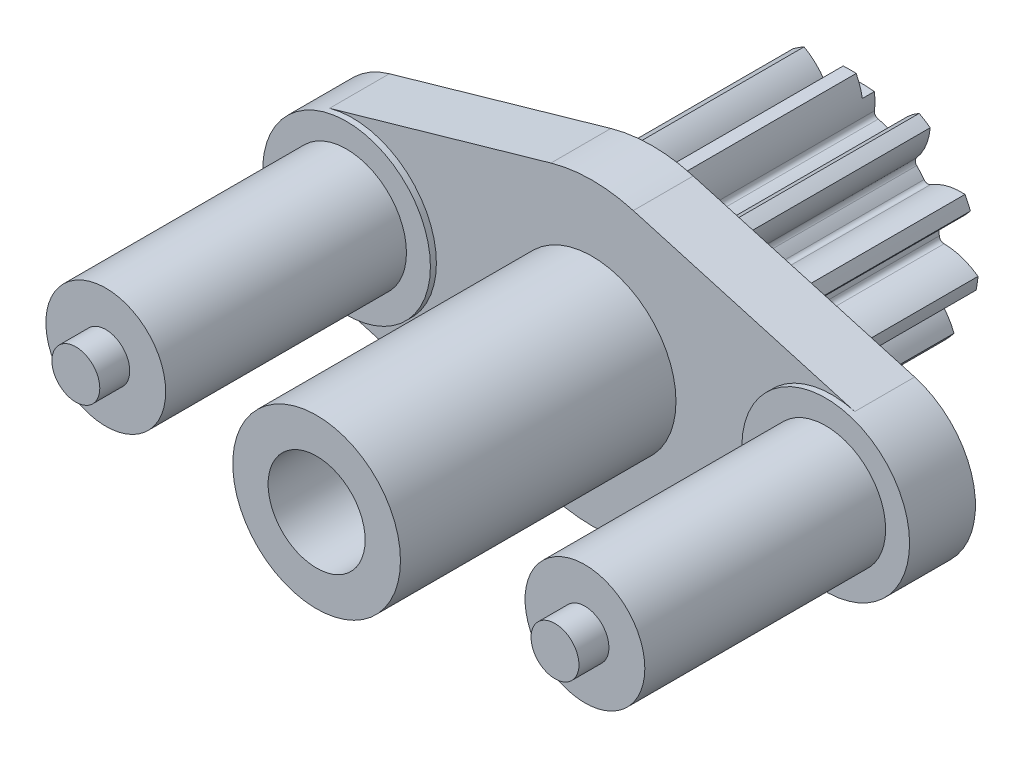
from build123d import *

# Parameters (mm, degrees)
ESQUISSE2_R                  = 9.75
BAUCHE_DENTURE_DEPTH         = 17.5
DENTURE_DEPTH                = 17.5
R_P_TITION_CIRCULAIRE1_COUNT = 11
EMBASE_DEPTH                 = 5
ESQUISSE4_R                  = 7
BOSSAGES_DEPTH               = 0.5
ESQUISSE5_R                  = 5
TOURILLONS_DEPTH             = 20.1
ESQUISSE6_R                  = 2
T_TONS_DEPTH                 = 2.5
ESQUISSE7_R                  = 2.5
ALL_GEMENTS_DEPTH            = 13
ESQUISSE8_R                  = 3.5
LAMAGES_DEPTH                = 2
ESQUISSE9_R                  = 4.05
AL_SAGE_DE_8_DEPTH           = 38.667758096
BOSS_EXTRU_1_START           = 23
ESQUISSE10_R                 = 7
ESQUISSE10_R_2               = 4.05
BOSS_EXTRU_1_DEPTH           = 23
ENL_V_MAT_EXTRU_1_DEPTH      = 1


with BuildPart() as part:
    # Esquisse2 → bauche denture (new body)
    with BuildSketch(Plane.XY):
        Circle(ESQUISSE2_R)
    extrude(amount=BAUCHE_DENTURE_DEPTH)

    # Esquisse1 → denture (cut)
    with BuildSketch(Plane.XY):
        with BuildLine():
            ThreePointArc((-0.540679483, 9.734996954), (-2.746298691, 9.35523081), (-4.807211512, 8.48252424))
            ThreePointArc((-4.807211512, 8.48252424), (-3.619475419, 7.548644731), (-2.775916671, 6.295146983))
            ThreePointArc((-2.775916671, 6.295146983), (-2.564941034, 6.093999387), (-2.27347869, 6.089441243))
            ThreePointArc((-2.27347869, 6.089441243), (-1.830865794, 6.23682054), (-1.378822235, 6.352074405))
            ThreePointArc((-1.378822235, 6.352074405), (-1.136072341, 6.513454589), (-1.067300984, 6.796724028))
            ThreePointArc((-1.067300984, 6.796724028), (-1.035154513, 8.307291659), (-0.540679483, 9.734996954))
        make_face()
    denture = extrude(amount=DENTURE_DEPTH, mode=Mode.SUBTRACT)

    # R_p_tition circulaire1: denture ×11 about axis
    r_p_tition_circulaire1_axis = Axis((0, 0, -50), (0, 0, 1))
    for i in range(1, R_P_TITION_CIRCULAIRE1_COUNT):
        add(denture.rotate(r_p_tition_circulaire1_axis, i * 360 / R_P_TITION_CIRCULAIRE1_COUNT), mode=Mode.SUBTRACT)

    # Esquisse3 → embase (add)
    with BuildSketch(Plane.XY.offset(17.5)):
        with BuildLine():
            Line((-21.925, 6.730109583), (-3.4375, 12.018052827))
            ThreePointArc((-3.4375, 12.018052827), (0, 12.5), (3.4375, 12.018052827))
            Line((3.4375, 12.018052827), (21.925, 6.730109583))
            ThreePointArc((21.925, 6.730109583), (27, 0), (21.925, -6.730109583))
            Line((21.925, -6.730109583), (3.4375, -12.018052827))
            ThreePointArc((3.4375, -12.018052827), (0, -12.5), (-3.4375, -12.018052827))
            Line((-3.4375, -12.018052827), (-21.925, -6.730109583))
            ThreePointArc((-21.925, -6.730109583), (-27, 0), (-21.925, 6.730109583))
        make_face()
    extrude(amount=EMBASE_DEPTH)

    # Esquisse4 → bossages (add)
    with BuildSketch(Plane.XY.offset(22.5)):
        with Locations(Location((20, 0, 0), (0, 0, 285.962014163))):
            Circle(ESQUISSE4_R)
        with Locations(Location((-20, 0, 0), (0, 0, 254.037985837))):
            Circle(ESQUISSE4_R)
    extrude(amount=BOSSAGES_DEPTH)

    # Esquisse5 → tourillons (add)
    with BuildSketch(Plane.XY.offset(23)):
        with Locations((20, 0)):
            Circle(ESQUISSE5_R)
        with Locations((-20, 0)):
            Circle(ESQUISSE5_R)
    extrude(amount=TOURILLONS_DEPTH)

    # Esquisse6 → t_tons (add)
    with BuildSketch(Plane.XY.offset(43.1)):
        with Locations((20, 0)):
            Circle(ESQUISSE6_R)
        with Locations((-20, 0)):
            Circle(ESQUISSE6_R)
    extrude(amount=T_TONS_DEPTH)

    # Esquisse7 → all_gements (cut)
    with BuildSketch(Plane(origin=(0, 0, 17.5), x_dir=(-1, 0, 0), z_dir=(0, 0, -1))):
        with Locations((-20, 0)):
            Circle(ESQUISSE7_R)
        with Locations((20, 0)):
            Circle(ESQUISSE7_R)
    extrude(amount=-ALL_GEMENTS_DEPTH, mode=Mode.SUBTRACT)

    # Esquisse8 → lamages (cut)
    with BuildSketch(Plane(origin=(0, 0, 17.5), x_dir=(-1, 0, 0), z_dir=(0, 0, -1))):
        with Locations((20, 0)):
            Circle(ESQUISSE8_R)
        with Locations((-20, 0)):
            Circle(ESQUISSE8_R)
    extrude(amount=-LAMAGES_DEPTH, mode=Mode.SUBTRACT)

    # Esquisse9 → al_sage de 8 (cut, through all)
    with BuildSketch(Plane.XY.offset(22.5)):
        Circle(ESQUISSE9_R)
    extrude(amount=-AL_SAGE_DE_8_DEPTH, mode=Mode.SUBTRACT)

    # Esquisse10 → Boss.-Extru.1 (add)
    with BuildSketch(Plane.XY.offset(22.5).offset(BOSS_EXTRU_1_START)):
        Circle(ESQUISSE10_R)
        Circle(ESQUISSE10_R_2, mode=Mode.SUBTRACT)
    extrude(amount=-BOSS_EXTRU_1_DEPTH)

    # Esquisse11 → Enl_v. mat.-Extru.1 (cut)
    with BuildSketch(Plane(origin=(0, 0, 0), x_dir=(-1, 0, 0), z_dir=(0, 0, -1))):
        with BuildLine():
            Line((-2.126229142, 7.971301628), (-3.914707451, 14.676364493))
            Line((-3.914707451, 14.676364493), (3.914707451, 14.676364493))
            Line((3.914707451, 14.676364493), (2.126229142, 7.971301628))
            ThreePointArc((2.126229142, 7.971301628), (0, 8.25), (-2.126229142, 7.971301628))
        make_face()
    extrude(amount=-ENL_V_MAT_EXTRU_1_DEPTH, mode=Mode.SUBTRACT)


solid = part.part
